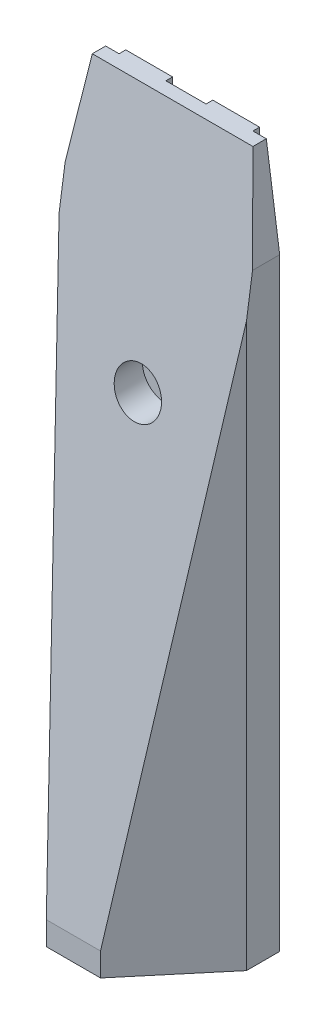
from build123d import *

# Parameters (mm, degrees)
BOSS_EXTRUDE1_DEPTH = 90.16
SKETCH3_W           = 1
SKETCH3_H           = 1
CUT_EXTRUDE1_DEPTH  = 3.5
SKETCH5_W           = 1
SKETCH5_H           = 1
CUT_EXTRUDE2_DEPTH  = 5
SKETCH6_W           = 24
SKETCH6_H           = 2
BOSS_EXTRUDE2_DEPTH = 6
SKETCH8_W           = 36.910120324
SKETCH8_H           = 125.452316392
CUT_EXTRUDE3_DEPTH  = 22
BOSS_EXTRUDE3_DEPTH = 1.5
SKETCH10_W          = 7
SKETCH10_H          = 6
BOSS_EXTRUDE4_DEPTH = 1
BOSS_EXTRUDE5_REACH = 58.491
SKETCH11_R          = 5
SKETCH11_R_2        = 3.5
SKETCH11_5_R        = 3.5
CUT_EXTRUDE4_DEPTH  = 30
SKETCH11_4_R        = 3.5
BOSS_EXTRUDE6_DEPTH = 3
SKETCH11_6_R        = 1.5
CUT_EXTRUDE5_DEPTH  = 30
CUT_EXTRUDE9_DEPTH  = 3.5


with BuildPart() as part:
    # Sketch2 → Boss-Extrude1 (new body)
    with BuildSketch(Plane(origin=(0, -52.08, 0), x_dir=(1, 0, 0), z_dir=(0, 1, 0))):
        Polygon((10.85, -5.369527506), (10.85, 1), (11.85, 1), (11.85, 0), (14, 0), (14, -4.96), (4.05, -16.82), (-4.05, -16.82), (-14, -4.96), (-14, 0), (-11.85, 0), (-11.85, 1), (-10.85, 1), (-10.85, -5.369527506), (-3.047327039, -14.67), (3.047327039, -14.67), align=None)
    extrude(amount=BOSS_EXTRUDE1_DEPTH)

    # Sketch3 → Cut-Extrude1 (cut)
    with BuildSketch(Plane(origin=(0, -52.08, 0), x_dir=(1, 0, 0), z_dir=(0, 1, 0))):
        with Locations((-11.35, 0.5)):
            Rectangle(SKETCH3_W, SKETCH3_H)
        with Locations((11.35, 0.5)):
            Rectangle(SKETCH3_W, SKETCH3_H)
    extrude(amount=CUT_EXTRUDE1_DEPTH, mode=Mode.SUBTRACT)

    # Sketch5 → Cut-Extrude2 (cut)
    with BuildSketch(Plane(origin=(0, 38.08, 0), x_dir=(1, 0, 0), z_dir=(0, 1, 0))):
        with Locations((-11.35, 0.5)):
            Rectangle(SKETCH5_W, SKETCH5_H)
        with Locations((11.35, 0.5)):
            Rectangle(SKETCH5_W, SKETCH5_H)
    extrude(amount=-CUT_EXTRUDE2_DEPTH, mode=Mode.SUBTRACT)

    # Sketch4 → section 1 of loft1
    with BuildSketch(Plane(origin=(0, 52.08, 0), x_dir=(1, 0, 0), z_dir=(0, 1, 0)), mode=Mode.PRIVATE) as loft1_s1:
        with BuildLine():
            Line((12, 0), (10, 0))
            Line((10, 0), (10, -3.504312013))
            Line((10, -3.504312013), (2.184561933, -12.82))
            Line((2.184561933, -12.82), (-2.184561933, -12.82))
            Line((-2.184561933, -12.82), (-10, -3.504312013))
            Line((-10, -3.504312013), (-10, 0))
            Line((-10, 0), (-12, 0))
            Line((-12, 0), (-12, -4.232156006))
            Line((-12, -4.232156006), (-3.117280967, -14.82))
            Line((-3.117280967, -14.82), (3.117280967, -14.82))
            Line((3.117280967, -14.82), (12, -4.232156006))
            Line((12, -4.232156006), (12, 0))
        make_face()
    # loft from a face of the part (loft1)
    loft([part.faces().sort_by_distance((7.19889929, 38.08, 10.22970017))[0], loft1_s1.sketch])

    # Sketch6 → Boss-Extrude2 (add)
    with BuildSketch(Plane(origin=(0, 52.08, 0), x_dir=(1, 0, 0), z_dir=(0, 1, 0))):
        with Locations((0, -1)):
            Rectangle(SKETCH6_W, SKETCH6_H)
    extrude(amount=-BOSS_EXTRUDE2_DEPTH)

    # Sketch8 → Cut-Extrude3 (cut)
    with BuildSketch(Plane(origin=(0, 1.393153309, 9.462537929), x_dir=(-1, 0, 0), z_dir=(0, -0.1456581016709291, -0.9893349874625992))):
        with Locations((0.037051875, -0.057588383)):
            Rectangle(SKETCH8_W, SKETCH8_H)
    extrude(amount=-CUT_EXTRUDE3_DEPTH, mode=Mode.SUBTRACT)

    # Sketch9 → Boss-Extrude3 (add)
    with BuildSketch(Plane(origin=(0, 1.393153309, 9.462537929), x_dir=(1, 0, 0), z_dir=(0, 0.1456581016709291, 0.9893349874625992))):
        Polygon((-4.05, -50.511862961), (4.05, -50.511862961), (14, 30.911688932), (14, 37.082330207), (12, 51.233249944), (-12, 51.233249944), (-14, 37.082330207), (-14, 30.911688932), align=None)
    extrude(amount=-BOSS_EXTRUDE3_DEPTH)

    # Sketch10 → Boss-Extrude4 (add)
    with BuildSketch(Plane(origin=(0, 0, 0), x_dir=(-1, 0, 0), z_dir=(0, 0, -1))):
        with Locations((-6.5, 49.08)):
            Rectangle(SKETCH10_W, SKETCH10_H)
        with Locations((6.5, 49.08)):
            Rectangle(SKETCH10_W, SKETCH10_H)
    extrude(amount=BOSS_EXTRUDE4_DEPTH)

    # Boss-Extrude5: up to this plane
    boss_extrude5_end = Plane(origin=(0, 1.174666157, 7.978535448), z_dir=(0, 0.1456581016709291, 0.9893349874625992))
    # Sketch11 → Boss-Extrude5 (add, up to the surface)
    with BuildSketch(Plane.XY, mode=Mode.PRIVATE) as boss_extrude5_sk1:
        with Locations(Location((0, 16.82, 0), (0, 0, 90))):
            Circle(SKETCH11_R)
        with Locations(Location((0, 16.82, 0), (0, 0, 90))):
            Circle(SKETCH11_R_2, mode=Mode.SUBTRACT)
    boss_extrude5_tool1 = split(extrude(boss_extrude5_sk1.sketch, amount=BOSS_EXTRUDE5_REACH, mode=Mode.PRIVATE), bisect_by=boss_extrude5_end, keep=Keep.BOTH, mode=Mode.PRIVATE)
    add(boss_extrude5_tool1.solids().sort_by_distance((0, 11.961421, 0))[0])

    # Sketch11_5 → Cut-Extrude4 (cut)
    with BuildSketch(Plane.XY):
        with Locations(Location((0, 16.82, 0), (0, 0, 90))):
            Circle(SKETCH11_5_R)
    extrude(amount=CUT_EXTRUDE4_DEPTH, mode=Mode.SUBTRACT)

    # Sketch11_4 → Boss-Extrude6 (add)
    with BuildSketch(Plane.XY):
        with Locations(Location((0, 16.82, 0), (0, 0, 90))):
            Circle(SKETCH11_4_R)
    extrude(amount=BOSS_EXTRUDE6_DEPTH)

    # Sketch11_6 → Cut-Extrude5 (cut)
    with BuildSketch(Plane.XY):
        with Locations((0, 16.82)):
            Circle(SKETCH11_6_R)
    extrude(amount=CUT_EXTRUDE5_DEPTH, mode=Mode.SUBTRACT)

    # Sketch12 → Cut-Extrude9 (cut)
    with BuildSketch(Plane.XZ.offset(52.08)):
        Polygon((-3.163916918, 14.92), (3.163916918, 14.92), (12.1, 4.268548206), (12.1, 0), (-12.1, 0), (-12.1, 4.268548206), align=None)
    extrude(amount=-CUT_EXTRUDE9_DEPTH, mode=Mode.SUBTRACT)


solid = part.part
